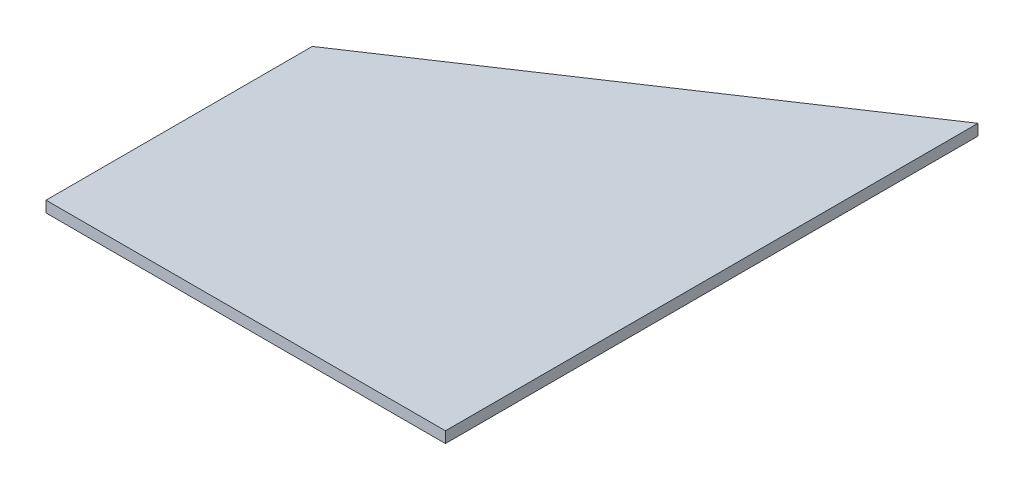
from build123d import *


with BuildPart() as part:
    # Sketch1 → Tapered_plywood_panel section 0
    with BuildSketch(Plane.YZ):
        with BuildLine():
            Line((76.2, -76.2), (82.55, -76.2))
            Line((82.55, -76.2), (82.55, 76.2))
            Line((82.55, 76.2), (76.2, 76.2))
            Line((76.2, 76.2), (76.2, -76.2))
        make_face()
    # Sketch2 → Tapered_plywood_panel section 1
    with BuildSketch(Plane.YZ.offset(304.8)):
        with BuildLine():
            Line((152.4, -152.4), (158.75, -152.4))
            Line((158.75, -152.4), (158.75, 152.4))
            Line((158.75, 152.4), (152.4, 152.4))
            Line((152.4, 152.4), (152.4, -152.4))
        make_face()
    loft()


solid = part.part
